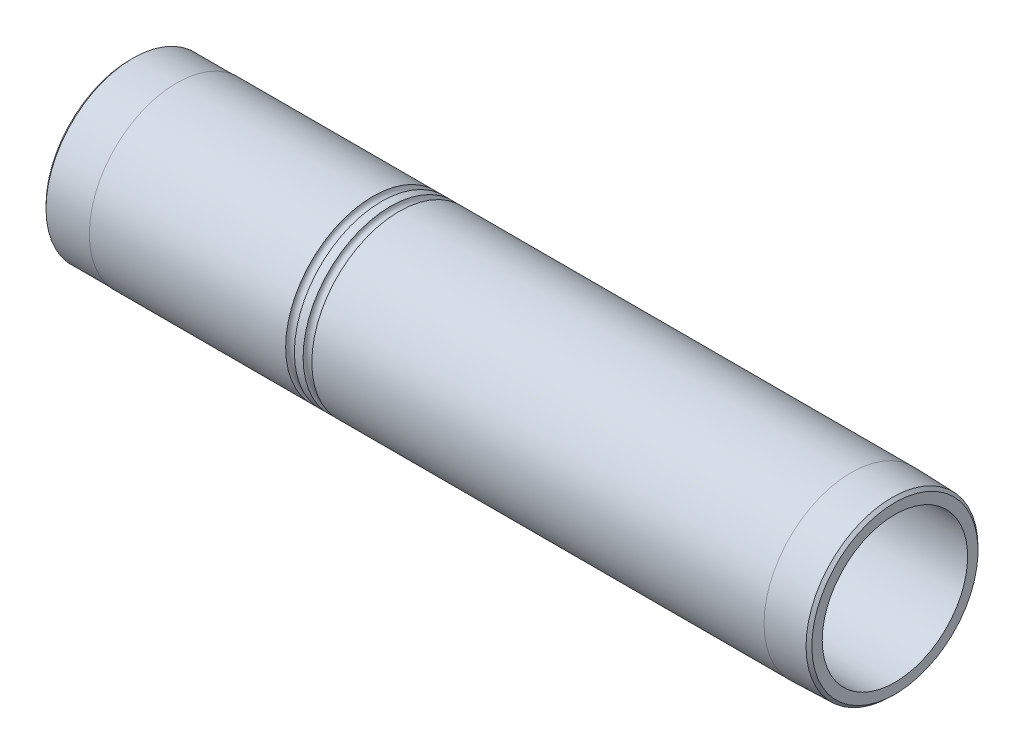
from build123d import *

# Parameters (mm, degrees)
SKETCH_27_W = 3.2
SKETCH_27_H = 26.75


with BuildPart() as part:
    # Sketch 1 → Revolve 1 (revolve)
    with BuildSketch(Plane.XY, mode=Mode.PRIVATE) as revolve_1_sk:
        Polygon((1, 30), (413, 30), (427, 29.565413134), (428, 28.565413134), (428, 25), (32, 25), (32, 25.35), (7, 25.35), (7, 26.85), (1.5, 26.85), (1.5, 25.85), (0.5, 25.85), (0, 26.35), (0, 29), align=None)
    revolve(revolve_1_sk.sketch.rotate(Axis((0, 0, 0), (1, 0, 0)), 90), axis=Axis((0, 0, 0), (1, 0, 0)))

    # Sketch 2 → Cut-Revolve 1 (revolve, cut)
    with BuildSketch(Plane.XY, mode=Mode.PRIVATE) as cut_revolve_1_sk:
        with BuildLine():
            Line((248.5, 29.975), (248.5, 31.475))
            Line((248.5, 31.475), (251.5, 31.475))
            Line((251.5, 31.475), (251.5, 29.975))
            ThreePointArc((251.5, 29.975), (250, 28.475), (248.5, 29.975))
        make_face()
        with BuildLine():
            Line((254.5, 31.475), (257.5, 31.475))
            Line((257.5, 31.475), (257.5, 29.975))
            ThreePointArc((257.5, 29.975), (256, 28.475), (254.5, 29.975))
            Line((254.5, 29.975), (254.5, 31.475))
        make_face()
    revolve(cut_revolve_1_sk.sketch.rotate(Axis((244, 0, 0), (1, 0, 0)), 90), axis=Axis((244, 0, 0), (1, 0, 0)), mode=Mode.SUBTRACT)

    # Sketch 10 → Cut-Revolve 2 (revolve, cut)
    with BuildSketch(Plane.XY, mode=Mode.PRIVATE) as cut_revolve_2_sk:
        Polygon((0, 0), (165, 0), (165, 28.9), (166, 29.9), (181, 29.9), (181, 39.9), (0, 39.9), align=None)
    revolve(cut_revolve_2_sk.sketch.rotate(Axis((0, 0, 0), (1, 0, 0)), 90), axis=Axis((0, 0, 0), (1, 0, 0)), mode=Mode.SUBTRACT)

    # Sketch 27 → Cut-Revolve 5 (revolve, cut)
    with BuildSketch(Plane.XY, mode=Mode.PRIVATE) as cut_revolve_5_sk:
        with Locations((213.4, 13.375)):
            Rectangle(SKETCH_27_W, SKETCH_27_H)
    revolve(cut_revolve_5_sk.sketch.rotate(Axis((211.8, 0, 0), (1, 0, 0)), 90), axis=Axis((211.8, 0, 0), (1, 0, 0)), mode=Mode.SUBTRACT)


solid = part.part
